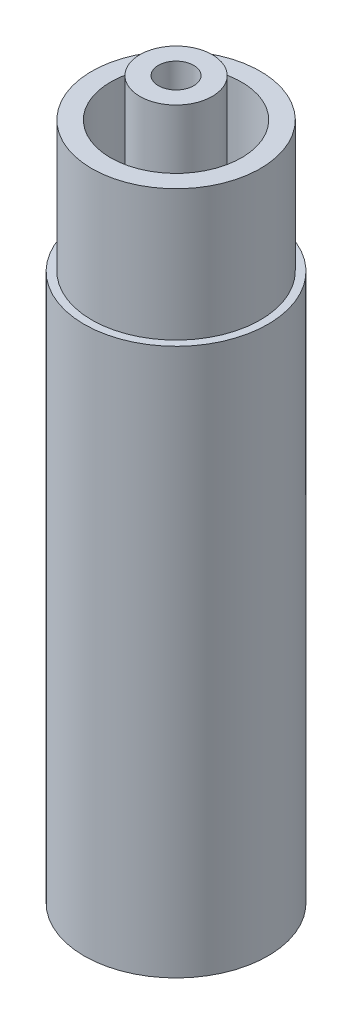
ISO-10303-21;
HEADER;
FILE_DESCRIPTION(('STEP AP214'),'2;1');
FILE_NAME('part.step','',(''),(''),'','','');
FILE_SCHEMA(('AUTOMOTIVE_DESIGN { 1 0 10303 214 1 1 1 1 }'));
ENDSEC;
DATA;
#1=APPLICATION_CONTEXT('core data for automotive mechanical design processes');
#2=APPLICATION_PROTOCOL_DEFINITION('international standard','automotive_design',2000,#1);
#3=PRODUCT_CONTEXT('',#1,'mechanical');
#4=PRODUCT('Part','Part','',(#3));
#5=PRODUCT_RELATED_PRODUCT_CATEGORY('part','',(#4));
#6=PRODUCT_DEFINITION_FORMATION('','',#4);
#7=PRODUCT_DEFINITION_CONTEXT('part definition',#1,'design');
#8=PRODUCT_DEFINITION('design','',#6,#7);
#9=PRODUCT_DEFINITION_SHAPE('','',#8);
#10=(LENGTH_UNIT() NAMED_UNIT(*) SI_UNIT(.MILLI.,.METRE.));
#11=(NAMED_UNIT(*) PLANE_ANGLE_UNIT() SI_UNIT($,.RADIAN.));
#12=(NAMED_UNIT(*) SI_UNIT($,.STERADIAN.) SOLID_ANGLE_UNIT());
#13=UNCERTAINTY_MEASURE_WITH_UNIT(LENGTH_MEASURE(1.E-05),#10,'distance_accuracy_value','');
#14=(GEOMETRIC_REPRESENTATION_CONTEXT(3) GLOBAL_UNCERTAINTY_ASSIGNED_CONTEXT((#13)) GLOBAL_UNIT_ASSIGNED_CONTEXT((#10,
#11,#12)) REPRESENTATION_CONTEXT('',''));
#15=CARTESIAN_POINT('',(0.,0.,0.));
#16=DIRECTION('',(0.,0.,1.));
#17=DIRECTION('',(1.,0.,0.));
#18=AXIS2_PLACEMENT_3D('',#15,#16,#17);
#19=CARTESIAN_POINT('',(-4.1275,6.35,0.));
#20=DIRECTION('',(0.,1.,0.));
#21=DIRECTION('',(-1.,0.,0.));
#22=AXIS2_PLACEMENT_3D('',#19,#20,#21);
#23=PLANE('',#22);
#24=CARTESIAN_POINT('',(0.,6.35,0.));
#25=DIRECTION('',(0.,-1.,0.));
#26=DIRECTION('',(1.,0.,0.));
#27=AXIS2_PLACEMENT_3D('',#24,#25,#26);
#28=CIRCLE('',#27,4.1275);
#29=CARTESIAN_POINT('',(4.1275,6.35,0.));
#30=VERTEX_POINT('',#29);
#31=EDGE_CURVE('E12',#30,#30,#28,.T.);
#32=ORIENTED_EDGE('',*,*,#31,.T.);
#33=EDGE_LOOP('',(#32));
#34=FACE_BOUND('',#33,.T.);
#35=ADVANCED_FACE('F44',(#34),#23,.F.);
#36=CARTESIAN_POINT('',(0.,0.,0.));
#37=DIRECTION('',(0.,-1.,0.));
#38=DIRECTION('',(1.,0.,0.));
#39=AXIS2_PLACEMENT_3D('',#36,#37,#38);
#40=CYLINDRICAL_SURFACE('',#39,4.1275);
#41=ORIENTED_EDGE('',*,*,#31,.F.);
#42=EDGE_LOOP('',(#41));
#43=FACE_BOUND('',#42,.T.);
#44=CARTESIAN_POINT('',(0.,10.16,0.));
#45=DIRECTION('',(0.,-1.,0.));
#46=DIRECTION('',(1.,0.,0.));
#47=AXIS2_PLACEMENT_3D('',#44,#45,#46);
#48=CIRCLE('',#47,4.1275);
#49=CARTESIAN_POINT('',(4.1275,10.16,0.));
#50=VERTEX_POINT('',#49);
#51=EDGE_CURVE('E50',#50,#50,#48,.T.);
#52=ORIENTED_EDGE('',*,*,#51,.T.);
#53=EDGE_LOOP('',(#52));
#54=FACE_BOUND('',#53,.T.);
#55=ADVANCED_FACE('F55',(#43,#54),#40,.T.);
#56=CARTESIAN_POINT('',(0.,11.6622871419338,0.));
#57=DIRECTION('',(0.,-1.,0.));
#58=DIRECTION('',(1.,0.,0.));
#59=AXIS2_PLACEMENT_3D('',#56,#57,#58);
#60=CONICAL_SURFACE('',#59,0.,1.22173047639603);
#61=ORIENTED_EDGE('',*,*,#51,.F.);
#62=EDGE_LOOP('',(#61));
#63=FACE_BOUND('',#62,.T.);
#64=CARTESIAN_POINT('',(0.,11.6622871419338,0.));
#65=VERTEX_POINT('',#64);
#66=VERTEX_LOOP('',#65);
#67=FACE_BOUND('',#66,.T.);
#68=ADVANCED_FACE('F53',(#63,#67),#60,.T.);
#69=CLOSED_SHELL('',(#35,#55,#68));
#70=MANIFOLD_SOLID_BREP('B2',#69);
#71=CARTESIAN_POINT('',(0.,0.,0.));
#72=DIRECTION('',(0.,1.,0.));
#73=DIRECTION('',(0.,0.,1.));
#74=AXIS2_PLACEMENT_3D('',#71,#72,#73);
#75=CYLINDRICAL_SURFACE('',#74,4.1402);
#76=CARTESIAN_POINT('',(0.,27.963486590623,0.));
#77=DIRECTION('',(0.,1.,0.));
#78=DIRECTION('',(0.,0.,1.));
#79=AXIS2_PLACEMENT_3D('',#76,#77,#78);
#80=CIRCLE('',#79,4.1402);
#81=CARTESIAN_POINT('',(0.,27.963486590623,-4.1402));
#82=VERTEX_POINT('',#81);
#83=EDGE_CURVE('E134',#82,#82,#80,.T.);
#84=ORIENTED_EDGE('',*,*,#83,.T.);
#85=EDGE_LOOP('',(#84));
#86=FACE_BOUND('',#85,.T.);
#87=CARTESIAN_POINT('',(0.,0.,0.));
#88=DIRECTION('',(0.,1.,0.));
#89=DIRECTION('',(0.,0.,1.));
#90=AXIS2_PLACEMENT_3D('',#87,#88,#89);
#91=CIRCLE('',#90,4.1402);
#92=CARTESIAN_POINT('',(0.,0.,4.1402));
#93=VERTEX_POINT('',#92);
#94=EDGE_CURVE('E43',#93,#93,#91,.T.);
#95=ORIENTED_EDGE('',*,*,#94,.F.);
#96=EDGE_LOOP('',(#95));
#97=FACE_BOUND('',#96,.T.);
#98=ADVANCED_FACE('F86',(#86,#97),#75,.F.);
#99=CARTESIAN_POINT('',(-4.1402,0.,0.));
#100=DIRECTION('',(0.,-1.,0.));
#101=DIRECTION('',(0.,0.,-1.));
#102=AXIS2_PLACEMENT_3D('',#99,#100,#101);
#103=PLANE('',#102);
#104=ORIENTED_EDGE('',*,*,#94,.T.);
#105=EDGE_LOOP('',(#104));
#106=FACE_BOUND('',#105,.T.);
#107=CARTESIAN_POINT('',(0.,0.,0.));
#108=DIRECTION('',(0.,1.,0.));
#109=DIRECTION('',(0.,0.,1.));
#110=AXIS2_PLACEMENT_3D('',#107,#108,#109);
#111=CIRCLE('',#110,5.16255);
#112=CARTESIAN_POINT('',(0.,0.,5.16255));
#113=VERTEX_POINT('',#112);
#114=EDGE_CURVE('E93',#113,#113,#111,.T.);
#115=ORIENTED_EDGE('',*,*,#114,.F.);
#116=EDGE_LOOP('',(#115));
#117=FACE_BOUND('',#116,.T.);
#118=ADVANCED_FACE('F152',(#106,#117),#103,.T.);
#119=CARTESIAN_POINT('',(0.,0.,0.));
#120=DIRECTION('',(0.,1.,0.));
#121=DIRECTION('',(0.,0.,1.));
#122=AXIS2_PLACEMENT_3D('',#119,#120,#121);
#123=CYLINDRICAL_SURFACE('',#122,5.16255);
#124=ORIENTED_EDGE('',*,*,#114,.T.);
#125=EDGE_LOOP('',(#124));
#126=FACE_BOUND('',#125,.T.);
#127=CARTESIAN_POINT('',(0.,30.734,0.));
#128=DIRECTION('',(0.,1.,0.));
#129=DIRECTION('',(0.,0.,1.));
#130=AXIS2_PLACEMENT_3D('',#127,#128,#129);
#131=CIRCLE('',#130,5.16255);
#132=CARTESIAN_POINT('',(0.,30.734,5.16255));
#133=VERTEX_POINT('',#132);
#134=EDGE_CURVE('E99',#133,#133,#131,.T.);
#135=ORIENTED_EDGE('',*,*,#134,.F.);
#136=EDGE_LOOP('',(#135));
#137=FACE_BOUND('',#136,.T.);
#138=ADVANCED_FACE('F156',(#126,#137),#123,.T.);
#139=CARTESIAN_POINT('',(-5.16255,30.734,0.));
#140=DIRECTION('',(0.,1.,0.));
#141=DIRECTION('',(0.,0.,1.));
#142=AXIS2_PLACEMENT_3D('',#139,#140,#141);
#143=PLANE('',#142);
#144=ORIENTED_EDGE('',*,*,#134,.T.);
#145=EDGE_LOOP('',(#144));
#146=FACE_BOUND('',#145,.T.);
#147=CARTESIAN_POINT('',(0.,30.734,0.));
#148=DIRECTION('',(0.,1.,0.));
#149=DIRECTION('',(0.,0.,1.));
#150=AXIS2_PLACEMENT_3D('',#147,#148,#149);
#151=CIRCLE('',#150,4.73710000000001);
#152=CARTESIAN_POINT('',(0.,30.734,4.73710000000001));
#153=VERTEX_POINT('',#152);
#154=EDGE_CURVE('E104',#153,#153,#151,.T.);
#155=ORIENTED_EDGE('',*,*,#154,.F.);
#156=EDGE_LOOP('',(#155));
#157=FACE_BOUND('',#156,.T.);
#158=ADVANCED_FACE('F160',(#146,#157),#143,.T.);
#159=CARTESIAN_POINT('',(0.,0.,0.));
#160=DIRECTION('',(0.,1.,0.));
#161=DIRECTION('',(0.,0.,1.));
#162=AXIS2_PLACEMENT_3D('',#159,#160,#161);
#163=CYLINDRICAL_SURFACE('',#162,4.7371);
#164=ORIENTED_EDGE('',*,*,#154,.T.);
#165=EDGE_LOOP('',(#164));
#166=FACE_BOUND('',#165,.T.);
#167=CARTESIAN_POINT('',(0.,38.1,0.));
#168=DIRECTION('',(0.,1.,0.));
#169=DIRECTION('',(0.,0.,1.));
#170=AXIS2_PLACEMENT_3D('',#167,#168,#169);
#171=CIRCLE('',#170,4.7371);
#172=CARTESIAN_POINT('',(0.,38.1,4.7371));
#173=VERTEX_POINT('',#172);
#174=EDGE_CURVE('E110',#173,#173,#171,.T.);
#175=ORIENTED_EDGE('',*,*,#174,.F.);
#176=EDGE_LOOP('',(#175));
#177=FACE_BOUND('',#176,.T.);
#178=ADVANCED_FACE('F166',(#166,#177),#163,.T.);
#179=CARTESIAN_POINT('',(-4.7371,38.1,0.));
#180=DIRECTION('',(0.,1.,0.));
#181=DIRECTION('',(0.,0.,1.));
#182=AXIS2_PLACEMENT_3D('',#179,#180,#181);
#183=PLANE('',#182);
#184=ORIENTED_EDGE('',*,*,#174,.T.);
#185=EDGE_LOOP('',(#184));
#186=FACE_BOUND('',#185,.T.);
#187=CARTESIAN_POINT('',(0.,38.1,0.));
#188=DIRECTION('',(0.,1.,0.));
#189=DIRECTION('',(0.,0.,1.));
#190=AXIS2_PLACEMENT_3D('',#187,#188,#189);
#191=CIRCLE('',#190,3.683);
#192=CARTESIAN_POINT('',(0.,38.1,3.683));
#193=VERTEX_POINT('',#192);
#194=EDGE_CURVE('E113',#193,#193,#191,.T.);
#195=ORIENTED_EDGE('',*,*,#194,.F.);
#196=EDGE_LOOP('',(#195));
#197=FACE_BOUND('',#196,.T.);
#198=ADVANCED_FACE('F170',(#186,#197),#183,.T.);
#199=CARTESIAN_POINT('',(0.,0.,0.));
#200=DIRECTION('',(0.,1.,0.));
#201=DIRECTION('',(0.,0.,1.));
#202=AXIS2_PLACEMENT_3D('',#199,#200,#201);
#203=CYLINDRICAL_SURFACE('',#202,3.683);
#204=ORIENTED_EDGE('',*,*,#194,.T.);
#205=EDGE_LOOP('',(#204));
#206=FACE_BOUND('',#205,.T.);
#207=CARTESIAN_POINT('',(0.,30.734,0.));
#208=DIRECTION('',(0.,1.,0.));
#209=DIRECTION('',(0.,0.,1.));
#210=AXIS2_PLACEMENT_3D('',#207,#208,#209);
#211=CIRCLE('',#210,3.683);
#212=CARTESIAN_POINT('',(0.,30.734,3.683));
#213=VERTEX_POINT('',#212);
#214=EDGE_CURVE('E116',#213,#213,#211,.T.);
#215=ORIENTED_EDGE('',*,*,#214,.F.);
#216=EDGE_LOOP('',(#215));
#217=FACE_BOUND('',#216,.T.);
#218=ADVANCED_FACE('F174',(#206,#217),#203,.F.);
#219=CARTESIAN_POINT('',(-3.683,30.734,0.));
#220=DIRECTION('',(0.,1.,0.));
#221=DIRECTION('',(0.,0.,1.));
#222=AXIS2_PLACEMENT_3D('',#219,#220,#221);
#223=PLANE('',#222);
#224=ORIENTED_EDGE('',*,*,#214,.T.);
#225=EDGE_LOOP('',(#224));
#226=FACE_BOUND('',#225,.T.);
#227=CARTESIAN_POINT('',(0.,30.734,0.));
#228=DIRECTION('',(0.,1.,0.));
#229=DIRECTION('',(0.,0.,1.));
#230=AXIS2_PLACEMENT_3D('',#227,#228,#229);
#231=CIRCLE('',#230,2.032);
#232=CARTESIAN_POINT('',(0.,30.734,2.032));
#233=VERTEX_POINT('',#232);
#234=EDGE_CURVE('E120',#233,#233,#231,.T.);
#235=ORIENTED_EDGE('',*,*,#234,.F.);
#236=EDGE_LOOP('',(#235));
#237=FACE_BOUND('',#236,.T.);
#238=ADVANCED_FACE('F178',(#226,#237),#223,.T.);
#239=CARTESIAN_POINT('',(0.,0.,0.));
#240=DIRECTION('',(0.,1.,0.));
#241=DIRECTION('',(0.,0.,1.));
#242=AXIS2_PLACEMENT_3D('',#239,#240,#241);
#243=CYLINDRICAL_SURFACE('',#242,2.032);
#244=ORIENTED_EDGE('',*,*,#234,.T.);
#245=EDGE_LOOP('',(#244));
#246=FACE_BOUND('',#245,.T.);
#247=CARTESIAN_POINT('',(0.,40.259,0.));
#248=DIRECTION('',(0.,1.,0.));
#249=DIRECTION('',(0.,0.,1.));
#250=AXIS2_PLACEMENT_3D('',#247,#248,#249);
#251=CIRCLE('',#250,2.032);
#252=CARTESIAN_POINT('',(0.,40.259,2.032));
#253=VERTEX_POINT('',#252);
#254=EDGE_CURVE('E124',#253,#253,#251,.T.);
#255=ORIENTED_EDGE('',*,*,#254,.F.);
#256=EDGE_LOOP('',(#255));
#257=FACE_BOUND('',#256,.T.);
#258=ADVANCED_FACE('F182',(#246,#257),#243,.T.);
#259=CARTESIAN_POINT('',(-2.032,40.259,0.));
#260=DIRECTION('',(0.,1.,0.));
#261=DIRECTION('',(0.,0.,1.));
#262=AXIS2_PLACEMENT_3D('',#259,#260,#261);
#263=PLANE('',#262);
#264=ORIENTED_EDGE('',*,*,#254,.T.);
#265=EDGE_LOOP('',(#264));
#266=FACE_BOUND('',#265,.T.);
#267=CARTESIAN_POINT('',(0.,40.259,0.));
#268=DIRECTION('',(0.,1.,0.));
#269=DIRECTION('',(0.,0.,1.));
#270=AXIS2_PLACEMENT_3D('',#267,#268,#269);
#271=CIRCLE('',#270,0.99450344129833);
#272=CARTESIAN_POINT('',(0.,40.259,0.99450344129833));
#273=VERTEX_POINT('',#272);
#274=EDGE_CURVE('E127',#273,#273,#271,.T.);
#275=ORIENTED_EDGE('',*,*,#274,.F.);
#276=EDGE_LOOP('',(#275));
#277=FACE_BOUND('',#276,.T.);
#278=ADVANCED_FACE('F148',(#266,#277),#263,.T.);
#279=CARTESIAN_POINT('',(0.,0.,0.));
#280=DIRECTION('',(0.,1.,0.));
#281=DIRECTION('',(0.,0.,1.));
#282=AXIS2_PLACEMENT_3D('',#279,#280,#281);
#283=CYLINDRICAL_SURFACE('',#282,0.99450344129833);
#284=ORIENTED_EDGE('',*,*,#274,.T.);
#285=EDGE_LOOP('',(#284));
#286=FACE_BOUND('',#285,.T.);
#287=CARTESIAN_POINT('',(0.,29.7796553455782,0.));
#288=DIRECTION('',(0.,1.,0.));
#289=DIRECTION('',(0.,0.,1.));
#290=AXIS2_PLACEMENT_3D('',#287,#288,#289);
#291=CIRCLE('',#290,0.99450344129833);
#292=CARTESIAN_POINT('',(0.,29.7796553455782,-0.994503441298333));
#293=VERTEX_POINT('',#292);
#294=EDGE_CURVE('E130',#293,#293,#291,.T.);
#295=ORIENTED_EDGE('',*,*,#294,.F.);
#296=EDGE_LOOP('',(#295));
#297=FACE_BOUND('',#296,.T.);
#298=ADVANCED_FACE('F142',(#286,#297),#283,.F.);
#299=CARTESIAN_POINT('',(0.,27.963486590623,0.));
#300=DIRECTION('',(0.,-1.,0.));
#301=DIRECTION('',(0.,0.,-1.));
#302=AXIS2_PLACEMENT_3D('',#299,#300,#301);
#303=CONICAL_SURFACE('',#302,4.1402,1.0471975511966);
#304=CARTESIAN_POINT('',(0.,29.7796553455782,-0.994503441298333));
#305=CARTESIAN_POINT('',(0.,29.7607369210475,-1.02727111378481));
#306=CARTESIAN_POINT('',(0.,29.7418184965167,-1.06003878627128));
#307=CARTESIAN_POINT('',(0.,29.7039816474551,-1.12557413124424));
#308=CARTESIAN_POINT('',(0.,29.6850632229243,-1.15834180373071));
#309=CARTESIAN_POINT('',(0.,29.6472263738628,-1.22387714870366));
#310=CARTESIAN_POINT('',(0.,29.628307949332,-1.25664482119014));
#311=CARTESIAN_POINT('',(0.,29.5904711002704,-1.32218016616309));
#312=CARTESIAN_POINT('',(0.,29.5715526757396,-1.35494783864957));
#313=CARTESIAN_POINT('',(0.,29.5337158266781,-1.42048318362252));
#314=CARTESIAN_POINT('',(0.,29.5147974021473,-1.45325085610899));
#315=CARTESIAN_POINT('',(0.,29.4769605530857,-1.51878620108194));
#316=CARTESIAN_POINT('',(0.,29.4580421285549,-1.55155387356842));
#317=CARTESIAN_POINT('',(0.,29.4202052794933,-1.61708921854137));
#318=CARTESIAN_POINT('',(0.,29.4012868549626,-1.64985689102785));
#319=CARTESIAN_POINT('',(0.,29.363450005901,-1.7153922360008));
#320=CARTESIAN_POINT('',(0.,29.3445315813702,-1.74815990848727));
#321=CARTESIAN_POINT('',(0.,29.3066947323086,-1.81369525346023));
#322=CARTESIAN_POINT('',(0.,29.2877763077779,-1.8464629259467));
#323=CARTESIAN_POINT('',(0.,29.2499394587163,-1.91199827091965));
#324=CARTESIAN_POINT('',(0.,29.2310210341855,-1.94476594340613));
#325=CARTESIAN_POINT('',(0.,29.1931841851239,-2.01030128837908));
#326=CARTESIAN_POINT('',(0.,29.1742657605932,-2.04306896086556));
#327=CARTESIAN_POINT('',(0.,29.1364289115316,-2.10860430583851));
#328=CARTESIAN_POINT('',(0.,29.1175104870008,-2.14137197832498));
#329=CARTESIAN_POINT('',(0.,29.0796736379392,-2.20690732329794));
#330=CARTESIAN_POINT('',(0.,29.0607552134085,-2.23967499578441));
#331=CARTESIAN_POINT('',(0.,29.0229183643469,-2.30521034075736));
#332=CARTESIAN_POINT('',(0.,29.0039999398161,-2.33797801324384));
#333=CARTESIAN_POINT('',(0.,28.9661630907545,-2.40351335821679));
#334=CARTESIAN_POINT('',(0.,28.9472446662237,-2.43628103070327));
#335=CARTESIAN_POINT('',(0.,28.9094078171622,-2.50181637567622));
#336=CARTESIAN_POINT('',(0.,28.8904893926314,-2.53458404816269));
#337=CARTESIAN_POINT('',(0.,28.8526525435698,-2.60011939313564));
#338=CARTESIAN_POINT('',(0.,28.833734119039,-2.63288706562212));
#339=CARTESIAN_POINT('',(0.,28.7958972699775,-2.69842241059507));
#340=CARTESIAN_POINT('',(0.,28.7769788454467,-2.73119008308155));
#341=CARTESIAN_POINT('',(0.,28.7391419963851,-2.7967254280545));
#342=CARTESIAN_POINT('',(0.,28.7202235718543,-2.82949310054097));
#343=CARTESIAN_POINT('',(0.,28.6823867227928,-2.89502844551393));
#344=CARTESIAN_POINT('',(0.,28.663468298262,-2.9277961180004));
#345=CARTESIAN_POINT('',(0.,28.6256314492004,-2.99333146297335));
#346=CARTESIAN_POINT('',(0.,28.6067130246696,-3.02609913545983));
#347=CARTESIAN_POINT('',(0.,28.5688761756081,-3.09163448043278));
#348=CARTESIAN_POINT('',(0.,28.5499577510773,-3.12440215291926));
#349=CARTESIAN_POINT('',(0.,28.5121209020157,-3.18993749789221));
#350=CARTESIAN_POINT('',(0.,28.4932024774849,-3.22270517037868));
#351=CARTESIAN_POINT('',(0.,28.4553656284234,-3.28824051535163));
#352=CARTESIAN_POINT('',(0.,28.4364472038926,-3.32100818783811));
#353=CARTESIAN_POINT('',(0.,28.398610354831,-3.38654353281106));
#354=CARTESIAN_POINT('',(0.,28.3796919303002,-3.41931120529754));
#355=CARTESIAN_POINT('',(0.,28.3418550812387,-3.48484655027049));
#356=CARTESIAN_POINT('',(0.,28.3229366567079,-3.51761422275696));
#357=CARTESIAN_POINT('',(0.,28.2850998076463,-3.58314956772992));
#358=CARTESIAN_POINT('',(0.,28.2661813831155,-3.61591724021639));
#359=CARTESIAN_POINT('',(0.,28.2283445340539,-3.68145258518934));
#360=CARTESIAN_POINT('',(0.,28.2094261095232,-3.71422025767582));
#361=CARTESIAN_POINT('',(0.,28.1715892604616,-3.77975560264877));
#362=CARTESIAN_POINT('',(0.,28.1526708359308,-3.81252327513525));
#363=CARTESIAN_POINT('',(0.,28.1148339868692,-3.8780586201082));
#364=CARTESIAN_POINT('',(0.,28.0959155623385,-3.91082629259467));
#365=CARTESIAN_POINT('',(0.,28.0580787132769,-3.97636163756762));
#366=CARTESIAN_POINT('',(0.,28.0391602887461,-4.0091293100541));
#367=CARTESIAN_POINT('',(0.,28.0013234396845,-4.07466465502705));
#368=CARTESIAN_POINT('',(0.,27.9824050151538,-4.10743232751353));
#369=CARTESIAN_POINT('',(0.,27.963486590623,-4.1402));
#370=B_SPLINE_CURVE_WITH_KNOTS('',3,(#304,#305,#306,#307,#308,#309,#310,#311,#312,#313,#314,
#315,#316,#317,#318,#319,#320,#321,#322,#323,#324,#325,#326,#327,#328,#329,#330,#331,#332,#333,
#334,#335,#336,#337,#338,#339,#340,#341,#342,#343,#344,#345,#346,#347,#348,#349,#350,#351,#352,
#353,#354,#355,#356,#357,#358,#359,#360,#361,#362,#363,#364,#365,#366,#367,#368,#369),
.UNSPECIFIED.,.F.,.F.,(4,2,2,2,2,2,2,2,2,2,2,2,2,2,2,2,2,2,2,2,2,2,2,2,2,2,2,2,2,2,2,2,4),(0.,
0.113510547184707,0.227021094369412,0.340531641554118,0.454042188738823,0.567552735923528,
0.681063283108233,0.794573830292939,0.908084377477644,1.02159492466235,1.13510547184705,
1.24861601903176,1.36212656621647,1.47563711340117,1.58914766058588,1.70265820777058,
1.81616875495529,1.92967930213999,2.0431898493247,2.1567003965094,2.27021094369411,
2.38372149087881,2.49723203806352,2.61074258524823,2.72425313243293,2.83776367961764,
2.95127422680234,3.06478477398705,3.17829532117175,3.29180586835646,3.40531641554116,
3.51882696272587,3.63233750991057),.UNSPECIFIED.);
#371=EDGE_CURVE('BSEAM140',#293,#82,#370,.T.);
#372=ORIENTED_EDGE('',*,*,#294,.T.);
#373=ORIENTED_EDGE('',*,*,#83,.F.);
#374=ORIENTED_EDGE('',*,*,#371,.T.);
#375=ORIENTED_EDGE('',*,*,#371,.F.);
#376=EDGE_LOOP('',(#372,#374,#373,#375));
#377=FACE_BOUND('',#376,.T.);
#378=ADVANCED_FACE('F140',(#377),#303,.F.);
#379=CLOSED_SHELL('',(#98,#118,#138,#158,#178,#198,#218,#238,#258,#278,#298,#378));
#380=MANIFOLD_SOLID_BREP('B6',#379);
#381=ADVANCED_BREP_SHAPE_REPRESENTATION('',(#18,#70,#380),#14);
#382=SHAPE_DEFINITION_REPRESENTATION(#9,#381);
ENDSEC;
END-ISO-10303-21;
